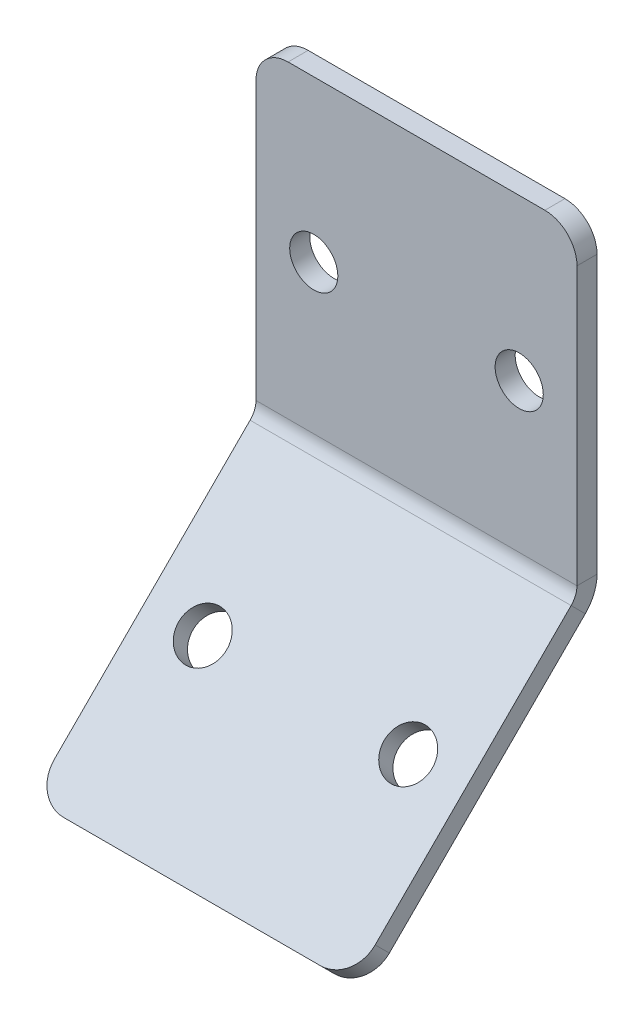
ISO-10303-21;
HEADER;
FILE_DESCRIPTION(('STEP AP214'),'2;1');
FILE_NAME('part.step','',(''),(''),'','','');
FILE_SCHEMA(('AUTOMOTIVE_DESIGN { 1 0 10303 214 1 1 1 1 }'));
ENDSEC;
DATA;
#1=APPLICATION_CONTEXT('core data for automotive mechanical design processes');
#2=APPLICATION_PROTOCOL_DEFINITION('international standard','automotive_design',2000,#1);
#3=PRODUCT_CONTEXT('',#1,'mechanical');
#4=PRODUCT('Part','Part','',(#3));
#5=PRODUCT_RELATED_PRODUCT_CATEGORY('part','',(#4));
#6=PRODUCT_DEFINITION_FORMATION('','',#4);
#7=PRODUCT_DEFINITION_CONTEXT('part definition',#1,'design');
#8=PRODUCT_DEFINITION('design','',#6,#7);
#9=PRODUCT_DEFINITION_SHAPE('','',#8);
#10=(LENGTH_UNIT() NAMED_UNIT(*) SI_UNIT(.MILLI.,.METRE.));
#11=(NAMED_UNIT(*) PLANE_ANGLE_UNIT() SI_UNIT($,.RADIAN.));
#12=(NAMED_UNIT(*) SI_UNIT($,.STERADIAN.) SOLID_ANGLE_UNIT());
#13=UNCERTAINTY_MEASURE_WITH_UNIT(LENGTH_MEASURE(1.E-05),#10,'distance_accuracy_value','');
#14=(GEOMETRIC_REPRESENTATION_CONTEXT(3) GLOBAL_UNCERTAINTY_ASSIGNED_CONTEXT((#13)) GLOBAL_UNIT_ASSIGNED_CONTEXT((#10,
#11,#12)) REPRESENTATION_CONTEXT('',''));
#15=CARTESIAN_POINT('',(0.,0.,0.));
#16=DIRECTION('',(0.,0.,1.));
#17=DIRECTION('',(1.,0.,0.));
#18=AXIS2_PLACEMENT_3D('',#15,#16,#17);
#19=CARTESIAN_POINT('',(-12.7,18.4343208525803,-16.5692701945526));
#20=DIRECTION('',(-1.,0.,0.));
#21=DIRECTION('',(0.,-0.707106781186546,0.707106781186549));
#22=AXIS2_PLACEMENT_3D('',#19,#20,#21);
#23=PLANE('',#22);
#24=DIRECTION('',(0.,0.707106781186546,-0.707106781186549));
#25=VECTOR('',#24,1.);
#26=CARTESIAN_POINT('',(-12.7,-0.648723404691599,0.268710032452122));
#27=LINE('',#26,#25);
#28=CARTESIAN_POINT('',(-12.7,-1.30994934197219,0.929935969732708));
#29=VERTEX_POINT('',#28);
#30=CARTESIAN_POINT('',(-12.7,-16.8131844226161,16.4331710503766));
#31=VERTEX_POINT('',#30);
#32=EDGE_CURVE('E179',#29,#31,#27,.F.);
#33=ORIENTED_EDGE('',*,*,#32,.T.);
#34=DIRECTION('',(0.,0.707106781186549,0.707106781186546));
#35=VECTOR('',#34,1.);
#36=CARTESIAN_POINT('',(-12.7,-15.6906524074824,17.5557030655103));
#37=LINE('',#36,#35);
#38=CARTESIAN_POINT('',(-12.7,-15.6906524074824,17.5557030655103));
#39=VERTEX_POINT('',#38);
#40=EDGE_CURVE('E178',#31,#39,#37,.T.);
#41=ORIENTED_EDGE('',*,*,#40,.T.);
#42=DIRECTION('',(0.,-0.707106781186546,0.707106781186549));
#43=VECTOR('',#42,1.);
#44=CARTESIAN_POINT('',(-12.7,18.4343208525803,-16.5692701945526));
#45=LINE('',#44,#43);
#46=CARTESIAN_POINT('',(-12.7,-0.187417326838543,2.05246798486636));
#47=VERTEX_POINT('',#46);
#48=EDGE_CURVE('E142',#47,#39,#45,.T.);
#49=ORIENTED_EDGE('',*,*,#48,.F.);
#50=DIRECTION('',(0.,-0.707106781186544,-0.707106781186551));
#51=VECTOR('',#50,1.);
#52=CARTESIAN_POINT('',(-12.7,-0.187417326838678,2.05246798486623));
#53=LINE('',#52,#51);
#54=EDGE_CURVE('E172',#47,#29,#53,.T.);
#55=ORIENTED_EDGE('',*,*,#54,.T.);
#56=EDGE_LOOP('',(#33,#41,#49,#55));
#57=FACE_BOUND('',#56,.T.);
#58=ADVANCED_FACE('F42',(#57),#23,.T.);
#59=CARTESIAN_POINT('',(12.7,18.4343208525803,-16.5692701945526));
#60=DIRECTION('',(1.,0.,0.));
#61=DIRECTION('',(0.,0.707106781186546,-0.707106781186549));
#62=AXIS2_PLACEMENT_3D('',#59,#60,#61);
#63=PLANE('',#62);
#64=DIRECTION('',(0.,0.707106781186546,-0.707106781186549));
#65=VECTOR('',#64,1.);
#66=CARTESIAN_POINT('',(12.7,18.4343208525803,-16.5692701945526));
#67=LINE('',#66,#65);
#68=CARTESIAN_POINT('',(12.7,-15.6906524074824,17.5557030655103));
#69=VERTEX_POINT('',#68);
#70=CARTESIAN_POINT('',(12.7,-0.187417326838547,2.05246798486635));
#71=VERTEX_POINT('',#70);
#72=EDGE_CURVE('E131',#69,#71,#67,.T.);
#73=ORIENTED_EDGE('',*,*,#72,.F.);
#74=DIRECTION('',(0.,0.707106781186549,0.707106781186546));
#75=VECTOR('',#74,1.);
#76=CARTESIAN_POINT('',(12.7,-15.6906524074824,17.5557030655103));
#77=LINE('',#76,#75);
#78=CARTESIAN_POINT('',(12.7,-16.813184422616,16.4331710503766));
#79=VERTEX_POINT('',#78);
#80=EDGE_CURVE('E201',#69,#79,#77,.F.);
#81=ORIENTED_EDGE('',*,*,#80,.T.);
#82=DIRECTION('',(0.,0.707106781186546,-0.707106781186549));
#83=VECTOR('',#82,1.);
#84=CARTESIAN_POINT('',(12.7,-0.648723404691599,0.268710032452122));
#85=LINE('',#84,#83);
#86=CARTESIAN_POINT('',(12.7,-1.30994934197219,0.929935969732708));
#87=VERTEX_POINT('',#86);
#88=EDGE_CURVE('E169',#79,#87,#85,.T.);
#89=ORIENTED_EDGE('',*,*,#88,.T.);
#90=DIRECTION('',(0.,0.707106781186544,0.707106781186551));
#91=VECTOR('',#90,1.);
#92=CARTESIAN_POINT('',(12.7,-0.187417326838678,2.05246798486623));
#93=LINE('',#92,#91);
#94=EDGE_CURVE('E154',#87,#71,#93,.T.);
#95=ORIENTED_EDGE('',*,*,#94,.T.);
#96=EDGE_LOOP('',(#73,#81,#89,#95));
#97=FACE_BOUND('',#96,.T.);
#98=ADVANCED_FACE('F167',(#97),#63,.T.);
#99=CARTESIAN_POINT('',(0.,0.473808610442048,1.39124204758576));
#100=DIRECTION('',(0.,0.707106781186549,0.707106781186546));
#101=DIRECTION('',(1.,0.,0.));
#102=AXIS2_PLACEMENT_3D('',#99,#100,#101);
#103=PLANE('',#102);
#104=CARTESIAN_POINT('',(8.12799999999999,-8.50644751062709,10.3714981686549));
#105=DIRECTION('',(0.,0.707106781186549,0.707106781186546));
#106=DIRECTION('',(-1.,0.,0.));
#107=AXIS2_PLACEMENT_3D('',#104,#105,#106);
#108=CIRCLE('',#107,1.905);
#109=CARTESIAN_POINT('',(6.22299999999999,-8.50644751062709,10.3714981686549));
#110=VERTEX_POINT('',#109);
#111=EDGE_CURVE('E155',#110,#110,#108,.T.);
#112=ORIENTED_EDGE('',*,*,#111,.F.);
#113=EDGE_LOOP('',(#112));
#114=FACE_BOUND('',#113,.T.);
#115=CARTESIAN_POINT('',(-8.128,-8.50644751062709,10.3714981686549));
#116=DIRECTION('',(0.,0.707106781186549,0.707106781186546));
#117=DIRECTION('',(1.,0.,0.));
#118=AXIS2_PLACEMENT_3D('',#115,#116,#117);
#119=CIRCLE('',#118,1.905);
#120=CARTESIAN_POINT('',(-6.223,-8.50644751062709,10.3714981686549));
#121=VERTEX_POINT('',#120);
#122=EDGE_CURVE('E143',#121,#121,#119,.T.);
#123=ORIENTED_EDGE('',*,*,#122,.F.);
#124=EDGE_LOOP('',(#123));
#125=FACE_BOUND('',#124,.T.);
#126=ORIENTED_EDGE('',*,*,#48,.T.);
#127=CARTESIAN_POINT('',(-10.16,-15.6906524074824,17.5557030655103));
#128=DIRECTION('',(0.,0.707106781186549,0.707106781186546));
#129=DIRECTION('',(0.,-0.707106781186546,0.707106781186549));
#130=AXIS2_PLACEMENT_3D('',#127,#128,#129);
#131=CIRCLE('',#130,2.54);
#132=CARTESIAN_POINT('',(-10.16,-17.4867036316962,19.3517542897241));
#133=VERTEX_POINT('',#132);
#134=EDGE_CURVE('E190',#39,#133,#131,.T.);
#135=ORIENTED_EDGE('',*,*,#134,.T.);
#136=DIRECTION('',(1.,0.,0.));
#137=VECTOR('',#136,1.);
#138=CARTESIAN_POINT('',(-12.7,-17.4867036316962,19.3517542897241));
#139=LINE('',#138,#137);
#140=CARTESIAN_POINT('',(10.16,-17.4867036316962,19.3517542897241));
#141=VERTEX_POINT('',#140);
#142=EDGE_CURVE('E185',#133,#141,#139,.T.);
#143=ORIENTED_EDGE('',*,*,#142,.T.);
#144=CARTESIAN_POINT('',(10.16,-15.6906524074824,17.5557030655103));
#145=DIRECTION('',(0.,0.707106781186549,0.707106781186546));
#146=DIRECTION('',(0.,-0.707106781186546,0.707106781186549));
#147=AXIS2_PLACEMENT_3D('',#144,#145,#146);
#148=CIRCLE('',#147,2.54);
#149=EDGE_CURVE('E138',#141,#69,#148,.T.);
#150=ORIENTED_EDGE('',*,*,#149,.T.);
#151=ORIENTED_EDGE('',*,*,#72,.T.);
#152=DIRECTION('',(-1.,0.,0.));
#153=VECTOR('',#152,1.);
#154=CARTESIAN_POINT('',(0.,-0.187417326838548,2.05246798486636));
#155=LINE('',#154,#153);
#156=EDGE_CURVE('E135',#71,#47,#155,.T.);
#157=ORIENTED_EDGE('',*,*,#156,.T.);
#158=EDGE_LOOP('',(#126,#135,#143,#150,#151,#157));
#159=FACE_BOUND('',#158,.T.);
#160=ADVANCED_FACE('F134',(#114,#125,#159),#103,.T.);
#161=CARTESIAN_POINT('',(-12.7,-17.4867036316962,19.3517542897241));
#162=DIRECTION('',(0.,-0.707106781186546,0.707106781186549));
#163=DIRECTION('',(1.,0.,0.));
#164=AXIS2_PLACEMENT_3D('',#161,#162,#163);
#165=PLANE('',#164);
#166=ORIENTED_EDGE('',*,*,#142,.F.);
#167=DIRECTION('',(0.,0.707106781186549,0.707106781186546));
#168=VECTOR('',#167,1.);
#169=CARTESIAN_POINT('',(-10.16,-17.4867036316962,19.3517542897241));
#170=LINE('',#169,#168);
#171=CARTESIAN_POINT('',(-10.16,-18.6092356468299,18.2292222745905));
#172=VERTEX_POINT('',#171);
#173=EDGE_CURVE('E195',#133,#172,#170,.F.);
#174=ORIENTED_EDGE('',*,*,#173,.T.);
#175=DIRECTION('',(1.,0.,0.));
#176=VECTOR('',#175,1.);
#177=CARTESIAN_POINT('',(0.,-18.6092356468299,18.2292222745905));
#178=LINE('',#177,#176);
#179=CARTESIAN_POINT('',(10.16,-18.6092356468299,18.2292222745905));
#180=VERTEX_POINT('',#179);
#181=EDGE_CURVE('E182',#172,#180,#178,.T.);
#182=ORIENTED_EDGE('',*,*,#181,.T.);
#183=DIRECTION('',(0.,0.707106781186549,0.707106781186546));
#184=VECTOR('',#183,1.);
#185=CARTESIAN_POINT('',(10.16,-17.4867036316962,19.3517542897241));
#186=LINE('',#185,#184);
#187=EDGE_CURVE('E192',#180,#141,#186,.T.);
#188=ORIENTED_EDGE('',*,*,#187,.T.);
#189=EDGE_LOOP('',(#166,#174,#182,#188));
#190=FACE_BOUND('',#189,.T.);
#191=ADVANCED_FACE('F287',(#190),#165,.T.);
#192=CARTESIAN_POINT('',(-8.128,-8.50644751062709,10.3714981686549));
#193=DIRECTION('',(0.,0.707106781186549,0.707106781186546));
#194=DIRECTION('',(1.,0.,0.));
#195=AXIS2_PLACEMENT_3D('',#192,#193,#194);
#196=CYLINDRICAL_SURFACE('',#195,1.905);
#197=ORIENTED_EDGE('',*,*,#122,.T.);
#198=EDGE_LOOP('',(#197));
#199=FACE_BOUND('',#198,.T.);
#200=CARTESIAN_POINT('',(-8.128,-9.62897952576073,9.24896615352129));
#201=DIRECTION('',(0.,0.707106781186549,0.707106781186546));
#202=DIRECTION('',(1.,0.,0.));
#203=AXIS2_PLACEMENT_3D('',#200,#201,#202);
#204=CIRCLE('',#203,1.905);
#205=CARTESIAN_POINT('',(-6.223,-9.62897952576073,9.24896615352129));
#206=VERTEX_POINT('',#205);
#207=EDGE_CURVE('E184',#206,#206,#204,.T.);
#208=ORIENTED_EDGE('',*,*,#207,.F.);
#209=EDGE_LOOP('',(#208));
#210=FACE_BOUND('',#209,.T.);
#211=ADVANCED_FACE('F277',(#199,#210),#196,.F.);
#212=CARTESIAN_POINT('',(8.12799999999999,-8.50644751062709,10.3714981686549));
#213=DIRECTION('',(0.,0.707106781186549,0.707106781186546));
#214=DIRECTION('',(1.,0.,0.));
#215=AXIS2_PLACEMENT_3D('',#212,#213,#214);
#216=CYLINDRICAL_SURFACE('',#215,1.905);
#217=ORIENTED_EDGE('',*,*,#111,.T.);
#218=EDGE_LOOP('',(#217));
#219=FACE_BOUND('',#218,.T.);
#220=CARTESIAN_POINT('',(8.12799999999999,-9.62897952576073,9.24896615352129));
#221=DIRECTION('',(0.,0.707106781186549,0.707106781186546));
#222=DIRECTION('',(1.,0.,0.));
#223=AXIS2_PLACEMENT_3D('',#220,#221,#222);
#224=CIRCLE('',#223,1.905);
#225=CARTESIAN_POINT('',(10.033,-9.62897952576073,9.24896615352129));
#226=VERTEX_POINT('',#225);
#227=EDGE_CURVE('E262',#226,#226,#224,.T.);
#228=ORIENTED_EDGE('',*,*,#227,.F.);
#229=EDGE_LOOP('',(#228));
#230=FACE_BOUND('',#229,.T.);
#231=ADVANCED_FACE('F275',(#219,#230),#216,.F.);
#232=CARTESIAN_POINT('',(0.,-0.648723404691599,0.268710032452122));
#233=DIRECTION('',(0.,0.707106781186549,0.707106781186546));
#234=DIRECTION('',(1.,0.,0.));
#235=AXIS2_PLACEMENT_3D('',#232,#233,#234);
#236=PLANE('',#235);
#237=ORIENTED_EDGE('',*,*,#181,.F.);
#238=CARTESIAN_POINT('',(-10.16,-16.813184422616,16.4331710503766));
#239=DIRECTION('',(0.,0.707106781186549,0.707106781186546));
#240=DIRECTION('',(0.,-0.707106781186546,0.707106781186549));
#241=AXIS2_PLACEMENT_3D('',#238,#239,#240);
#242=CIRCLE('',#241,2.54);
#243=EDGE_CURVE('E199',#172,#31,#242,.F.);
#244=ORIENTED_EDGE('',*,*,#243,.T.);
#245=ORIENTED_EDGE('',*,*,#32,.F.);
#246=DIRECTION('',(-1.,0.,0.));
#247=VECTOR('',#246,1.);
#248=CARTESIAN_POINT('',(0.,-1.30994934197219,0.929935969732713));
#249=LINE('',#248,#247);
#250=EDGE_CURVE('E170',#87,#29,#249,.T.);
#251=ORIENTED_EDGE('',*,*,#250,.F.);
#252=ORIENTED_EDGE('',*,*,#88,.F.);
#253=CARTESIAN_POINT('',(10.16,-16.813184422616,16.4331710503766));
#254=DIRECTION('',(0.,0.707106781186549,0.707106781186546));
#255=DIRECTION('',(0.,-0.707106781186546,0.707106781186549));
#256=AXIS2_PLACEMENT_3D('',#253,#254,#255);
#257=CIRCLE('',#256,2.54);
#258=EDGE_CURVE('E197',#79,#180,#257,.F.);
#259=ORIENTED_EDGE('',*,*,#258,.T.);
#260=EDGE_LOOP('',(#237,#244,#245,#251,#252,#259));
#261=FACE_BOUND('',#260,.T.);
#262=ORIENTED_EDGE('',*,*,#207,.T.);
#263=EDGE_LOOP('',(#262));
#264=FACE_BOUND('',#263,.T.);
#265=ORIENTED_EDGE('',*,*,#227,.T.);
#266=EDGE_LOOP('',(#265));
#267=FACE_BOUND('',#266,.T.);
#268=ADVANCED_FACE('F273',(#261,#264,#267),#236,.F.);
#269=CARTESIAN_POINT('',(8.128,12.7,1.5875));
#270=DIRECTION('',(0.,0.,1.));
#271=DIRECTION('',(1.,0.,0.));
#272=AXIS2_PLACEMENT_3D('',#269,#270,#271);
#273=CYLINDRICAL_SURFACE('',#272,1.905);
#274=CARTESIAN_POINT('',(8.128,12.7,1.5875));
#275=DIRECTION('',(0.,0.,1.));
#276=DIRECTION('',(1.,0.,0.));
#277=AXIS2_PLACEMENT_3D('',#274,#275,#276);
#278=CIRCLE('',#277,1.905);
#279=CARTESIAN_POINT('',(10.033,12.7,1.5875));
#280=VERTEX_POINT('',#279);
#281=EDGE_CURVE('E251',#280,#280,#278,.T.);
#282=ORIENTED_EDGE('',*,*,#281,.T.);
#283=EDGE_LOOP('',(#282));
#284=FACE_BOUND('',#283,.T.);
#285=CARTESIAN_POINT('',(8.128,12.7,0.));
#286=DIRECTION('',(0.,0.,1.));
#287=DIRECTION('',(1.,0.,0.));
#288=AXIS2_PLACEMENT_3D('',#285,#286,#287);
#289=CIRCLE('',#288,1.905);
#290=CARTESIAN_POINT('',(10.033,12.7,0.));
#291=VERTEX_POINT('',#290);
#292=EDGE_CURVE('E228',#291,#291,#289,.T.);
#293=ORIENTED_EDGE('',*,*,#292,.F.);
#294=EDGE_LOOP('',(#293));
#295=FACE_BOUND('',#294,.T.);
#296=ADVANCED_FACE('F284',(#284,#295),#273,.F.);
#297=CARTESIAN_POINT('',(-8.12799999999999,12.7,1.5875));
#298=DIRECTION('',(0.,0.,1.));
#299=DIRECTION('',(1.,0.,0.));
#300=AXIS2_PLACEMENT_3D('',#297,#298,#299);
#301=CYLINDRICAL_SURFACE('',#300,1.905);
#302=CARTESIAN_POINT('',(-8.12799999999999,12.7,1.5875));
#303=DIRECTION('',(0.,0.,1.));
#304=DIRECTION('',(-1.,0.,0.));
#305=AXIS2_PLACEMENT_3D('',#302,#303,#304);
#306=CIRCLE('',#305,1.905);
#307=CARTESIAN_POINT('',(-10.033,12.7,1.5875));
#308=VERTEX_POINT('',#307);
#309=EDGE_CURVE('E248',#308,#308,#306,.T.);
#310=ORIENTED_EDGE('',*,*,#309,.T.);
#311=EDGE_LOOP('',(#310));
#312=FACE_BOUND('',#311,.T.);
#313=CARTESIAN_POINT('',(-8.12799999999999,12.7,0.));
#314=DIRECTION('',(0.,0.,1.));
#315=DIRECTION('',(1.,0.,0.));
#316=AXIS2_PLACEMENT_3D('',#313,#314,#315);
#317=CIRCLE('',#316,1.905);
#318=CARTESIAN_POINT('',(-6.22299999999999,12.7,0.));
#319=VERTEX_POINT('',#318);
#320=EDGE_CURVE('E329',#319,#319,#317,.T.);
#321=ORIENTED_EDGE('',*,*,#320,.F.);
#322=EDGE_LOOP('',(#321));
#323=FACE_BOUND('',#322,.T.);
#324=ADVANCED_FACE('F338',(#312,#323),#301,.F.);
#325=CARTESIAN_POINT('',(-12.7,25.4,1.5875));
#326=DIRECTION('',(0.,1.,0.));
#327=DIRECTION('',(-1.,0.,0.));
#328=AXIS2_PLACEMENT_3D('',#325,#326,#327);
#329=PLANE('',#328);
#330=DIRECTION('',(-1.,0.,0.));
#331=VECTOR('',#330,1.);
#332=CARTESIAN_POINT('',(-12.7,25.4,1.5875));
#333=LINE('',#332,#331);
#334=CARTESIAN_POINT('',(10.16,25.4,1.5875));
#335=VERTEX_POINT('',#334);
#336=CARTESIAN_POINT('',(-10.16,25.4,1.5875));
#337=VERTEX_POINT('',#336);
#338=EDGE_CURVE('E237',#335,#337,#333,.T.);
#339=ORIENTED_EDGE('',*,*,#338,.F.);
#340=DIRECTION('',(0.,0.,1.));
#341=VECTOR('',#340,1.);
#342=CARTESIAN_POINT('',(10.16,25.4,1.5875));
#343=LINE('',#342,#341);
#344=CARTESIAN_POINT('',(10.16,25.4,0.));
#345=VERTEX_POINT('',#344);
#346=EDGE_CURVE('E213',#335,#345,#343,.F.);
#347=ORIENTED_EDGE('',*,*,#346,.T.);
#348=DIRECTION('',(1.,0.,0.));
#349=VECTOR('',#348,1.);
#350=CARTESIAN_POINT('',(0.,25.4,0.));
#351=LINE('',#350,#349);
#352=CARTESIAN_POINT('',(-10.16,25.4,0.));
#353=VERTEX_POINT('',#352);
#354=EDGE_CURVE('E220',#345,#353,#351,.F.);
#355=ORIENTED_EDGE('',*,*,#354,.T.);
#356=DIRECTION('',(0.,0.,1.));
#357=VECTOR('',#356,1.);
#358=CARTESIAN_POINT('',(-10.16,25.4,1.5875));
#359=LINE('',#358,#357);
#360=EDGE_CURVE('E210',#353,#337,#359,.T.);
#361=ORIENTED_EDGE('',*,*,#360,.T.);
#362=EDGE_LOOP('',(#339,#347,#355,#361));
#363=FACE_BOUND('',#362,.T.);
#364=ADVANCED_FACE('F241',(#363),#329,.T.);
#365=CARTESIAN_POINT('',(0.,0.,1.5875));
#366=DIRECTION('',(0.,0.,1.));
#367=DIRECTION('',(1.,0.,0.));
#368=AXIS2_PLACEMENT_3D('',#365,#366,#367);
#369=PLANE('',#368);
#370=DIRECTION('',(0.,1.,0.));
#371=VECTOR('',#370,1.);
#372=CARTESIAN_POINT('',(12.7,25.4,1.5875));
#373=LINE('',#372,#371);
#374=CARTESIAN_POINT('',(12.7,0.935114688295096,1.5875));
#375=VERTEX_POINT('',#374);
#376=CARTESIAN_POINT('',(12.7,22.86,1.5875));
#377=VERTEX_POINT('',#376);
#378=EDGE_CURVE('E239',#375,#377,#373,.T.);
#379=ORIENTED_EDGE('',*,*,#378,.T.);
#380=CARTESIAN_POINT('',(10.16,22.86,1.5875));
#381=DIRECTION('',(0.,0.,1.));
#382=DIRECTION('',(1.,0.,0.));
#383=AXIS2_PLACEMENT_3D('',#380,#381,#382);
#384=CIRCLE('',#383,2.54);
#385=EDGE_CURVE('E208',#377,#335,#384,.T.);
#386=ORIENTED_EDGE('',*,*,#385,.T.);
#387=ORIENTED_EDGE('',*,*,#338,.T.);
#388=CARTESIAN_POINT('',(-10.16,22.86,1.5875));
#389=DIRECTION('',(0.,0.,1.));
#390=DIRECTION('',(1.,0.,0.));
#391=AXIS2_PLACEMENT_3D('',#388,#389,#390);
#392=CIRCLE('',#391,2.54);
#393=CARTESIAN_POINT('',(-12.7,22.86,1.5875));
#394=VERTEX_POINT('',#393);
#395=EDGE_CURVE('E206',#337,#394,#392,.T.);
#396=ORIENTED_EDGE('',*,*,#395,.T.);
#397=DIRECTION('',(0.,-1.,0.));
#398=VECTOR('',#397,1.);
#399=CARTESIAN_POINT('',(-12.7,25.4,1.5875));
#400=LINE('',#399,#398);
#401=CARTESIAN_POINT('',(-12.7,0.935114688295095,1.5875));
#402=VERTEX_POINT('',#401);
#403=EDGE_CURVE('E229',#394,#402,#400,.T.);
#404=ORIENTED_EDGE('',*,*,#403,.T.);
#405=DIRECTION('',(-1.,0.,0.));
#406=VECTOR('',#405,1.);
#407=CARTESIAN_POINT('',(0.,0.935114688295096,1.5875));
#408=LINE('',#407,#406);
#409=EDGE_CURVE('E258',#375,#402,#408,.T.);
#410=ORIENTED_EDGE('',*,*,#409,.F.);
#411=EDGE_LOOP('',(#379,#386,#387,#396,#404,#410));
#412=FACE_BOUND('',#411,.T.);
#413=ORIENTED_EDGE('',*,*,#309,.F.);
#414=EDGE_LOOP('',(#413));
#415=FACE_BOUND('',#414,.T.);
#416=ORIENTED_EDGE('',*,*,#281,.F.);
#417=EDGE_LOOP('',(#416));
#418=FACE_BOUND('',#417,.T.);
#419=ADVANCED_FACE('F235',(#412,#415,#418),#369,.T.);
#420=CARTESIAN_POINT('',(12.7,25.4,1.5875));
#421=DIRECTION('',(1.,0.,0.));
#422=DIRECTION('',(0.,1.,0.));
#423=AXIS2_PLACEMENT_3D('',#420,#421,#422);
#424=PLANE('',#423);
#425=DIRECTION('',(0.,1.,0.));
#426=VECTOR('',#425,1.);
#427=CARTESIAN_POINT('',(12.7,0.,0.));
#428=LINE('',#427,#426);
#429=CARTESIAN_POINT('',(12.7,0.935114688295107,0.));
#430=VERTEX_POINT('',#429);
#431=CARTESIAN_POINT('',(12.7,22.86,0.));
#432=VERTEX_POINT('',#431);
#433=EDGE_CURVE('E219',#430,#432,#428,.T.);
#434=ORIENTED_EDGE('',*,*,#433,.T.);
#435=DIRECTION('',(0.,0.,1.));
#436=VECTOR('',#435,1.);
#437=CARTESIAN_POINT('',(12.7,22.86,1.5875));
#438=LINE('',#437,#436);
#439=EDGE_CURVE('E203',#432,#377,#438,.T.);
#440=ORIENTED_EDGE('',*,*,#439,.T.);
#441=ORIENTED_EDGE('',*,*,#378,.F.);
#442=DIRECTION('',(0.,0.,1.));
#443=VECTOR('',#442,1.);
#444=CARTESIAN_POINT('',(12.7,0.935114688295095,1.58749999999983));
#445=LINE('',#444,#443);
#446=EDGE_CURVE('E164',#430,#375,#445,.T.);
#447=ORIENTED_EDGE('',*,*,#446,.F.);
#448=EDGE_LOOP('',(#434,#440,#441,#447));
#449=FACE_BOUND('',#448,.T.);
#450=ADVANCED_FACE('F225',(#449),#424,.T.);
#451=CARTESIAN_POINT('',(0.,0.,0.));
#452=DIRECTION('',(0.,0.,1.));
#453=DIRECTION('',(1.,0.,0.));
#454=AXIS2_PLACEMENT_3D('',#451,#452,#453);
#455=PLANE('',#454);
#456=ORIENTED_EDGE('',*,*,#292,.T.);
#457=EDGE_LOOP('',(#456));
#458=FACE_BOUND('',#457,.T.);
#459=ORIENTED_EDGE('',*,*,#320,.T.);
#460=EDGE_LOOP('',(#459));
#461=FACE_BOUND('',#460,.T.);
#462=ORIENTED_EDGE('',*,*,#354,.F.);
#463=CARTESIAN_POINT('',(10.16,22.86,0.));
#464=DIRECTION('',(0.,0.,1.));
#465=DIRECTION('',(1.,0.,0.));
#466=AXIS2_PLACEMENT_3D('',#463,#464,#465);
#467=CIRCLE('',#466,2.54);
#468=EDGE_CURVE('E50',#345,#432,#467,.F.);
#469=ORIENTED_EDGE('',*,*,#468,.T.);
#470=ORIENTED_EDGE('',*,*,#433,.F.);
#471=DIRECTION('',(-1.,0.,0.));
#472=VECTOR('',#471,1.);
#473=CARTESIAN_POINT('',(0.,0.935114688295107,0.));
#474=LINE('',#473,#472);
#475=CARTESIAN_POINT('',(-12.7,0.935114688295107,0.));
#476=VERTEX_POINT('',#475);
#477=EDGE_CURVE('E327',#430,#476,#474,.T.);
#478=ORIENTED_EDGE('',*,*,#477,.T.);
#479=DIRECTION('',(0.,1.,0.));
#480=VECTOR('',#479,1.);
#481=CARTESIAN_POINT('',(-12.7,0.,0.));
#482=LINE('',#481,#480);
#483=CARTESIAN_POINT('',(-12.7,22.86,0.));
#484=VERTEX_POINT('',#483);
#485=EDGE_CURVE('E268',#484,#476,#482,.F.);
#486=ORIENTED_EDGE('',*,*,#485,.F.);
#487=CARTESIAN_POINT('',(-10.16,22.86,0.));
#488=DIRECTION('',(0.,0.,1.));
#489=DIRECTION('',(1.,0.,0.));
#490=AXIS2_PLACEMENT_3D('',#487,#488,#489);
#491=CIRCLE('',#490,2.54);
#492=EDGE_CURVE('E62',#484,#353,#491,.F.);
#493=ORIENTED_EDGE('',*,*,#492,.T.);
#494=EDGE_LOOP('',(#462,#469,#470,#478,#486,#493));
#495=FACE_BOUND('',#494,.T.);
#496=ADVANCED_FACE('F217',(#458,#461,#495),#455,.F.);
#497=CARTESIAN_POINT('',(-12.7,25.4,1.5875));
#498=DIRECTION('',(-1.,0.,0.));
#499=DIRECTION('',(0.,-1.,0.));
#500=AXIS2_PLACEMENT_3D('',#497,#498,#499);
#501=PLANE('',#500);
#502=ORIENTED_EDGE('',*,*,#403,.F.);
#503=DIRECTION('',(0.,0.,1.));
#504=VECTOR('',#503,1.);
#505=CARTESIAN_POINT('',(-12.7,22.86,1.5875));
#506=LINE('',#505,#504);
#507=EDGE_CURVE('E12',#394,#484,#506,.F.);
#508=ORIENTED_EDGE('',*,*,#507,.T.);
#509=ORIENTED_EDGE('',*,*,#485,.T.);
#510=DIRECTION('',(0.,0.,-1.));
#511=VECTOR('',#510,1.);
#512=CARTESIAN_POINT('',(-12.7,0.935114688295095,1.58749999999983));
#513=LINE('',#512,#511);
#514=EDGE_CURVE('E255',#402,#476,#513,.T.);
#515=ORIENTED_EDGE('',*,*,#514,.F.);
#516=EDGE_LOOP('',(#502,#508,#509,#515));
#517=FACE_BOUND('',#516,.T.);
#518=ADVANCED_FACE('F316',(#517),#501,.T.);
#519=CARTESIAN_POINT('',(12.7,0.935114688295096,3.175));
#520=DIRECTION('',(-1.,0.,0.));
#521=DIRECTION('',(0.,0.,1.));
#522=AXIS2_PLACEMENT_3D('',#519,#520,#521);
#523=PLANE('',#522);
#524=ORIENTED_EDGE('',*,*,#94,.F.);
#525=CARTESIAN_POINT('',(12.7,0.935114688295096,3.175));
#526=DIRECTION('',(1.,0.,0.));
#527=DIRECTION('',(0.,0.,-1.));
#528=AXIS2_PLACEMENT_3D('',#525,#526,#527);
#529=CIRCLE('',#528,3.175);
#530=EDGE_CURVE('E323',#87,#430,#529,.T.);
#531=ORIENTED_EDGE('',*,*,#530,.T.);
#532=ORIENTED_EDGE('',*,*,#446,.T.);
#533=CARTESIAN_POINT('',(12.7,0.935114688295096,3.175));
#534=DIRECTION('',(1.,0.,0.));
#535=DIRECTION('',(0.,0.,-1.));
#536=AXIS2_PLACEMENT_3D('',#533,#534,#535);
#537=CIRCLE('',#536,1.5875);
#538=EDGE_CURVE('E150',#71,#375,#537,.T.);
#539=ORIENTED_EDGE('',*,*,#538,.F.);
#540=EDGE_LOOP('',(#524,#531,#532,#539));
#541=FACE_BOUND('',#540,.T.);
#542=ADVANCED_FACE('F160',(#541),#523,.F.);
#543=CARTESIAN_POINT('',(-12.7,0.935114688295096,3.175));
#544=DIRECTION('',(1.,0.,0.));
#545=DIRECTION('',(0.,0.,-1.));
#546=AXIS2_PLACEMENT_3D('',#543,#544,#545);
#547=PLANE('',#546);
#548=CARTESIAN_POINT('',(-12.7,0.935114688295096,3.175));
#549=DIRECTION('',(1.,0.,0.));
#550=DIRECTION('',(0.,0.,-1.));
#551=AXIS2_PLACEMENT_3D('',#548,#549,#550);
#552=CIRCLE('',#551,3.175);
#553=EDGE_CURVE('E165',#476,#29,#552,.F.);
#554=ORIENTED_EDGE('',*,*,#553,.T.);
#555=ORIENTED_EDGE('',*,*,#54,.F.);
#556=CARTESIAN_POINT('',(-12.7,0.935114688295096,3.175));
#557=DIRECTION('',(-1.,0.,0.));
#558=DIRECTION('',(0.,0.,1.));
#559=AXIS2_PLACEMENT_3D('',#556,#557,#558);
#560=CIRCLE('',#559,1.5875);
#561=EDGE_CURVE('E152',#402,#47,#560,.T.);
#562=ORIENTED_EDGE('',*,*,#561,.F.);
#563=ORIENTED_EDGE('',*,*,#514,.T.);
#564=EDGE_LOOP('',(#554,#555,#562,#563));
#565=FACE_BOUND('',#564,.T.);
#566=ADVANCED_FACE('F320',(#565),#547,.F.);
#567=CARTESIAN_POINT('',(-25.5181879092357,0.935114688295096,3.175));
#568=DIRECTION('',(1.,0.,0.));
#569=DIRECTION('',(0.,0.,-1.));
#570=AXIS2_PLACEMENT_3D('',#567,#568,#569);
#571=CYLINDRICAL_SURFACE('',#570,1.5875);
#572=ORIENTED_EDGE('',*,*,#409,.T.);
#573=ORIENTED_EDGE('',*,*,#561,.T.);
#574=ORIENTED_EDGE('',*,*,#156,.F.);
#575=ORIENTED_EDGE('',*,*,#538,.T.);
#576=EDGE_LOOP('',(#572,#573,#574,#575));
#577=FACE_BOUND('',#576,.T.);
#578=ADVANCED_FACE('F149',(#577),#571,.F.);
#579=CARTESIAN_POINT('',(-25.5181879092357,0.935114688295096,3.175));
#580=DIRECTION('',(1.,0.,0.));
#581=DIRECTION('',(0.,0.,-1.));
#582=AXIS2_PLACEMENT_3D('',#579,#580,#581);
#583=CYLINDRICAL_SURFACE('',#582,3.175);
#584=ORIENTED_EDGE('',*,*,#477,.F.);
#585=ORIENTED_EDGE('',*,*,#530,.F.);
#586=ORIENTED_EDGE('',*,*,#250,.T.);
#587=ORIENTED_EDGE('',*,*,#553,.F.);
#588=EDGE_LOOP('',(#584,#585,#586,#587));
#589=FACE_BOUND('',#588,.T.);
#590=ADVANCED_FACE('F304',(#589),#583,.T.);
#591=CARTESIAN_POINT('',(-10.16,-15.6906524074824,17.5557030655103));
#592=DIRECTION('',(0.,0.707106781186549,0.707106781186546));
#593=DIRECTION('',(0.,-0.707106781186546,0.707106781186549));
#594=AXIS2_PLACEMENT_3D('',#591,#592,#593);
#595=CYLINDRICAL_SURFACE('',#594,2.54);
#596=ORIENTED_EDGE('',*,*,#243,.F.);
#597=ORIENTED_EDGE('',*,*,#173,.F.);
#598=ORIENTED_EDGE('',*,*,#134,.F.);
#599=ORIENTED_EDGE('',*,*,#40,.F.);
#600=EDGE_LOOP('',(#596,#597,#598,#599));
#601=FACE_BOUND('',#600,.T.);
#602=ADVANCED_FACE('F300',(#601),#595,.T.);
#603=CARTESIAN_POINT('',(10.16,-15.6906524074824,17.5557030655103));
#604=DIRECTION('',(0.,0.707106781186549,0.707106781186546));
#605=DIRECTION('',(0.,-0.707106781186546,0.707106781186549));
#606=AXIS2_PLACEMENT_3D('',#603,#604,#605);
#607=CYLINDRICAL_SURFACE('',#606,2.54);
#608=ORIENTED_EDGE('',*,*,#258,.F.);
#609=ORIENTED_EDGE('',*,*,#80,.F.);
#610=ORIENTED_EDGE('',*,*,#149,.F.);
#611=ORIENTED_EDGE('',*,*,#187,.F.);
#612=EDGE_LOOP('',(#608,#609,#610,#611));
#613=FACE_BOUND('',#612,.T.);
#614=ADVANCED_FACE('F303',(#613),#607,.T.);
#615=CARTESIAN_POINT('',(10.16,22.86,1.5875));
#616=DIRECTION('',(0.,0.,1.));
#617=DIRECTION('',(1.,0.,0.));
#618=AXIS2_PLACEMENT_3D('',#615,#616,#617);
#619=CYLINDRICAL_SURFACE('',#618,2.54);
#620=ORIENTED_EDGE('',*,*,#468,.F.);
#621=ORIENTED_EDGE('',*,*,#346,.F.);
#622=ORIENTED_EDGE('',*,*,#385,.F.);
#623=ORIENTED_EDGE('',*,*,#439,.F.);
#624=EDGE_LOOP('',(#620,#621,#622,#623));
#625=FACE_BOUND('',#624,.T.);
#626=ADVANCED_FACE('F231',(#625),#619,.T.);
#627=CARTESIAN_POINT('',(-10.16,22.86,1.5875));
#628=DIRECTION('',(0.,0.,1.));
#629=DIRECTION('',(1.,0.,0.));
#630=AXIS2_PLACEMENT_3D('',#627,#628,#629);
#631=CYLINDRICAL_SURFACE('',#630,2.54);
#632=ORIENTED_EDGE('',*,*,#492,.F.);
#633=ORIENTED_EDGE('',*,*,#507,.F.);
#634=ORIENTED_EDGE('',*,*,#395,.F.);
#635=ORIENTED_EDGE('',*,*,#360,.F.);
#636=EDGE_LOOP('',(#632,#633,#634,#635));
#637=FACE_BOUND('',#636,.T.);
#638=ADVANCED_FACE('F44',(#637),#631,.T.);
#639=CLOSED_SHELL('',(#58,#98,#160,#191,#211,#231,#268,#296,#324,#364,#419,#450,#496,#518,#542,
#566,#578,#590,#602,#614,#626,#638));
#640=MANIFOLD_SOLID_BREP('B2',#639);
#641=ADVANCED_BREP_SHAPE_REPRESENTATION('',(#18,#640),#14);
#642=SHAPE_DEFINITION_REPRESENTATION(#9,#641);
ENDSEC;
END-ISO-10303-21;
